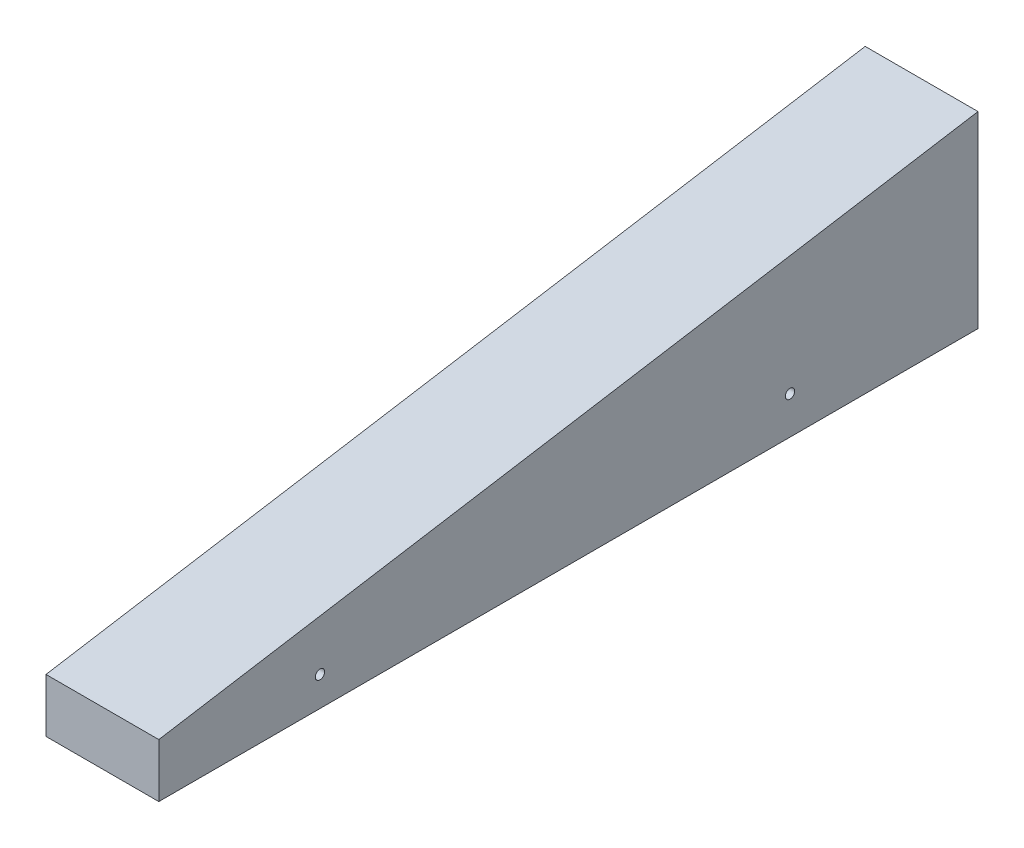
from build123d import *

# Parameters (mm, degrees)
STOCK_MATERIAL_DEPTH      = 21
SKETCH2_R                 = 10
POWER_PLANT_CHAMBER_DEPTH = 51
AXLE_CUTOUTS_DEPTH        = 170.107214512
AXLE_CUTOUTS_DEPTH_BACK   = 170.107214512
AXLE_LAYOUT_SKETCH_R      = 1.75


with BuildPart() as part:
    # Sketch1 → Stock Material (new, symmetric)
    with BuildSketch(Plane(origin=(0, 0, 0), x_dir=(0, 0, -1), z_dir=(1, 0, 0))):
        Polygon((-152.5, 0), (152.5, 0), (152.5, 70), (-152.5, 20), align=None)
    extrude(amount=STOCK_MATERIAL_DEPTH, both=True)

    # Sketch2 → Power Plant Chamber (cut)
    with BuildSketch(Plane(origin=(0, 0, -152.5), x_dir=(-1, 0, 0), z_dir=(0, 0, -1))):
        with Locations((0, 32)):
            Circle(SKETCH2_R)
    extrude(amount=-POWER_PLANT_CHAMBER_DEPTH, mode=Mode.SUBTRACT)

    # Axle Layout Sketch → Axle Cutouts (cut, two sides: drawn at the far end of the back side and taken through both)
    with BuildSketch(Plane(origin=(0, 0, 0), x_dir=(0, 0, -1), z_dir=(1, 0, 0)).offset(-AXLE_CUTOUTS_DEPTH_BACK)):
        with Locations((-92.5, 11)):
            Circle(AXLE_LAYOUT_SKETCH_R)
        with Locations((82.5, 14)):
            Circle(AXLE_LAYOUT_SKETCH_R)
    extrude(amount=AXLE_CUTOUTS_DEPTH + AXLE_CUTOUTS_DEPTH_BACK, mode=Mode.SUBTRACT)


solid = part.part
